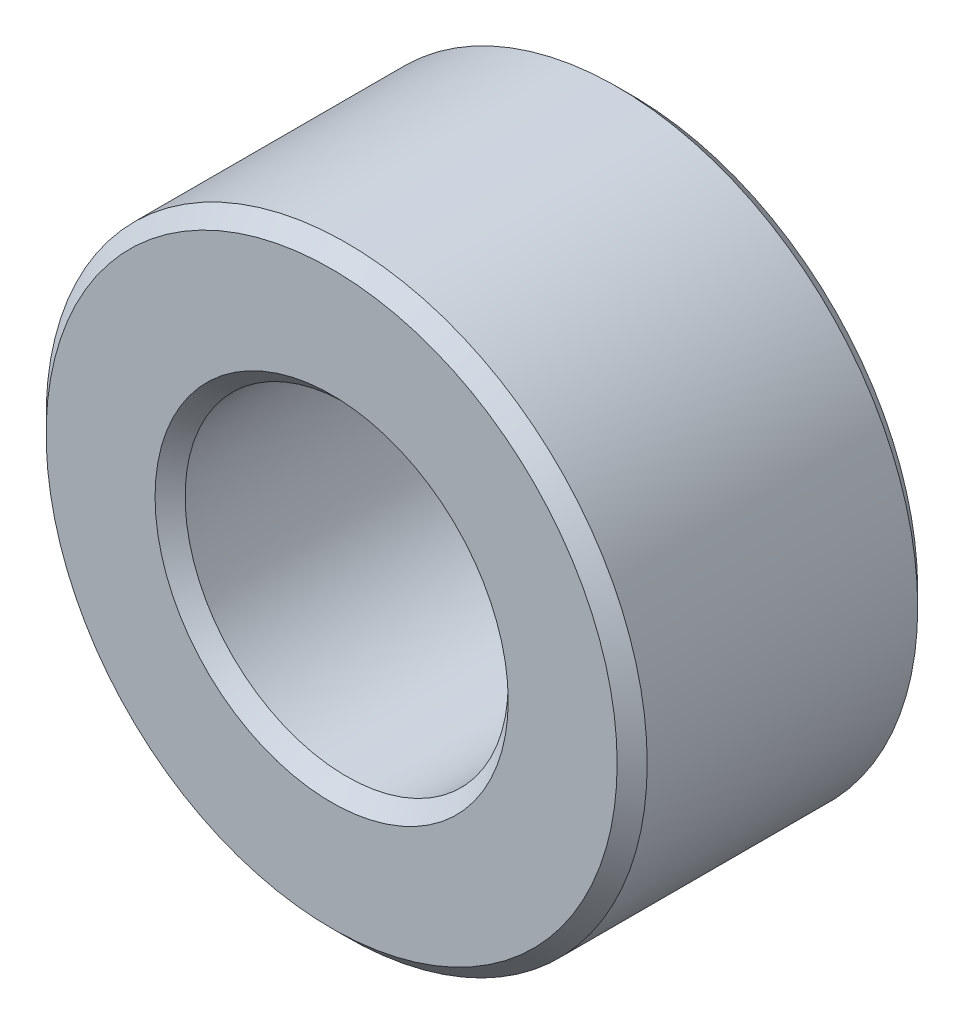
ISO-10303-21;
HEADER;
FILE_DESCRIPTION(('STEP AP214'),'2;1');
FILE_NAME('part.step','',(''),(''),'','','');
FILE_SCHEMA(('AUTOMOTIVE_DESIGN { 1 0 10303 214 1 1 1 1 }'));
ENDSEC;
DATA;
#1=APPLICATION_CONTEXT('core data for automotive mechanical design processes');
#2=APPLICATION_PROTOCOL_DEFINITION('international standard','automotive_design',2000,#1);
#3=PRODUCT_CONTEXT('',#1,'mechanical');
#4=PRODUCT('Part','Part','',(#3));
#5=PRODUCT_RELATED_PRODUCT_CATEGORY('part','',(#4));
#6=PRODUCT_DEFINITION_FORMATION('','',#4);
#7=PRODUCT_DEFINITION_CONTEXT('part definition',#1,'design');
#8=PRODUCT_DEFINITION('design','',#6,#7);
#9=PRODUCT_DEFINITION_SHAPE('','',#8);
#10=(LENGTH_UNIT() NAMED_UNIT(*) SI_UNIT(.MILLI.,.METRE.));
#11=(NAMED_UNIT(*) PLANE_ANGLE_UNIT() SI_UNIT($,.RADIAN.));
#12=(NAMED_UNIT(*) SI_UNIT($,.STERADIAN.) SOLID_ANGLE_UNIT());
#13=UNCERTAINTY_MEASURE_WITH_UNIT(LENGTH_MEASURE(1.E-05),#10,'distance_accuracy_value','');
#14=(GEOMETRIC_REPRESENTATION_CONTEXT(3) GLOBAL_UNCERTAINTY_ASSIGNED_CONTEXT((#13)) GLOBAL_UNIT_ASSIGNED_CONTEXT((#10,
#11,#12)) REPRESENTATION_CONTEXT('',''));
#15=CARTESIAN_POINT('',(0.,0.,0.));
#16=DIRECTION('',(0.,0.,1.));
#17=DIRECTION('',(1.,0.,0.));
#18=AXIS2_PLACEMENT_3D('',#15,#16,#17);
#19=CARTESIAN_POINT('',(0.,0.,2.));
#20=DIRECTION('',(0.,0.,1.));
#21=DIRECTION('',(1.,0.,0.));
#22=AXIS2_PLACEMENT_3D('',#19,#20,#21);
#23=PLANE('',#22);
#24=CARTESIAN_POINT('',(0.,0.,2.));
#25=DIRECTION('',(0.,0.,1.));
#26=DIRECTION('',(1.,0.,0.));
#27=AXIS2_PLACEMENT_3D('',#24,#25,#26);
#28=CIRCLE('',#27,2.35);
#29=CARTESIAN_POINT('',(2.35,0.,2.));
#30=VERTEX_POINT('',#29);
#31=EDGE_CURVE('E10',#30,#30,#28,.F.);
#32=ORIENTED_EDGE('',*,*,#31,.T.);
#33=EDGE_LOOP('',(#32));
#34=FACE_BOUND('',#33,.T.);
#35=CARTESIAN_POINT('',(0.,0.,2.));
#36=DIRECTION('',(0.,0.,1.));
#37=DIRECTION('',(1.,0.,0.));
#38=AXIS2_PLACEMENT_3D('',#35,#36,#37);
#39=CIRCLE('',#38,3.8);
#40=CARTESIAN_POINT('',(3.8,0.,2.));
#41=VERTEX_POINT('',#40);
#42=EDGE_CURVE('E45',#41,#41,#39,.T.);
#43=ORIENTED_EDGE('',*,*,#42,.T.);
#44=EDGE_LOOP('',(#43));
#45=FACE_BOUND('',#44,.T.);
#46=ADVANCED_FACE('F37',(#34,#45),#23,.T.);
#47=CARTESIAN_POINT('',(0.,0.,-2.));
#48=DIRECTION('',(0.,0.,1.));
#49=DIRECTION('',(1.,0.,0.));
#50=AXIS2_PLACEMENT_3D('',#47,#48,#49);
#51=PLANE('',#50);
#52=CARTESIAN_POINT('',(0.,0.,-2.));
#53=DIRECTION('',(0.,0.,1.));
#54=DIRECTION('',(1.,0.,0.));
#55=AXIS2_PLACEMENT_3D('',#52,#53,#54);
#56=CIRCLE('',#55,3.8);
#57=CARTESIAN_POINT('',(3.8,0.,-2.));
#58=VERTEX_POINT('',#57);
#59=EDGE_CURVE('E62',#58,#58,#56,.F.);
#60=ORIENTED_EDGE('',*,*,#59,.T.);
#61=EDGE_LOOP('',(#60));
#62=FACE_BOUND('',#61,.T.);
#63=CARTESIAN_POINT('',(0.,0.,-2.));
#64=DIRECTION('',(0.,0.,1.));
#65=DIRECTION('',(1.,0.,0.));
#66=AXIS2_PLACEMENT_3D('',#63,#64,#65);
#67=CIRCLE('',#66,2.35);
#68=CARTESIAN_POINT('',(2.35,0.,-2.));
#69=VERTEX_POINT('',#68);
#70=EDGE_CURVE('E65',#69,#69,#67,.T.);
#71=ORIENTED_EDGE('',*,*,#70,.T.);
#72=EDGE_LOOP('',(#71));
#73=FACE_BOUND('',#72,.T.);
#74=ADVANCED_FACE('F89',(#62,#73),#51,.F.);
#75=CARTESIAN_POINT('',(0.,0.,2.));
#76=DIRECTION('',(0.,0.,-1.));
#77=DIRECTION('',(-1.,0.,0.));
#78=AXIS2_PLACEMENT_3D('',#75,#76,#77);
#79=CYLINDRICAL_SURFACE('',#78,4.);
#80=CARTESIAN_POINT('',(0.,0.,-1.8));
#81=DIRECTION('',(0.,0.,1.));
#82=DIRECTION('',(1.,0.,0.));
#83=AXIS2_PLACEMENT_3D('',#80,#81,#82);
#84=CIRCLE('',#83,4.);
#85=CARTESIAN_POINT('',(4.,0.,-1.8));
#86=VERTEX_POINT('',#85);
#87=EDGE_CURVE('E69',#86,#86,#84,.T.);
#88=ORIENTED_EDGE('',*,*,#87,.T.);
#89=EDGE_LOOP('',(#88));
#90=FACE_BOUND('',#89,.T.);
#91=CARTESIAN_POINT('',(0.,0.,1.8));
#92=DIRECTION('',(0.,0.,1.));
#93=DIRECTION('',(1.,0.,0.));
#94=AXIS2_PLACEMENT_3D('',#91,#92,#93);
#95=CIRCLE('',#94,4.);
#96=CARTESIAN_POINT('',(4.,0.,1.8));
#97=VERTEX_POINT('',#96);
#98=EDGE_CURVE('E73',#97,#97,#95,.F.);
#99=ORIENTED_EDGE('',*,*,#98,.T.);
#100=EDGE_LOOP('',(#99));
#101=FACE_BOUND('',#100,.T.);
#102=ADVANCED_FACE('F78',(#90,#101),#79,.T.);
#103=CARTESIAN_POINT('',(0.,0.,2.));
#104=DIRECTION('',(0.,0.,-1.));
#105=DIRECTION('',(-1.,0.,0.));
#106=AXIS2_PLACEMENT_3D('',#103,#104,#105);
#107=CYLINDRICAL_SURFACE('',#106,2.15);
#108=CARTESIAN_POINT('',(0.,0.,-1.8));
#109=DIRECTION('',(0.,0.,1.));
#110=DIRECTION('',(1.,0.,0.));
#111=AXIS2_PLACEMENT_3D('',#108,#109,#110);
#112=CIRCLE('',#111,2.15);
#113=CARTESIAN_POINT('',(2.15,0.,-1.8));
#114=VERTEX_POINT('',#113);
#115=EDGE_CURVE('E51',#114,#114,#112,.F.);
#116=ORIENTED_EDGE('',*,*,#115,.T.);
#117=EDGE_LOOP('',(#116));
#118=FACE_BOUND('',#117,.T.);
#119=CARTESIAN_POINT('',(0.,0.,1.8));
#120=DIRECTION('',(0.,0.,1.));
#121=DIRECTION('',(1.,0.,0.));
#122=AXIS2_PLACEMENT_3D('',#119,#120,#121);
#123=CIRCLE('',#122,2.15);
#124=CARTESIAN_POINT('',(2.15,0.,1.8));
#125=VERTEX_POINT('',#124);
#126=EDGE_CURVE('E57',#125,#125,#123,.T.);
#127=ORIENTED_EDGE('',*,*,#126,.T.);
#128=EDGE_LOOP('',(#127));
#129=FACE_BOUND('',#128,.T.);
#130=ADVANCED_FACE('F97',(#118,#129),#107,.F.);
#131=CARTESIAN_POINT('',(0.,0.,-1.8));
#132=DIRECTION('',(0.,0.,1.));
#133=DIRECTION('',(1.,0.,0.));
#134=AXIS2_PLACEMENT_3D('',#131,#132,#133);
#135=CONICAL_SURFACE('',#134,4.,0.785398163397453);
#136=ORIENTED_EDGE('',*,*,#59,.F.);
#137=EDGE_LOOP('',(#136));
#138=FACE_BOUND('',#137,.T.);
#139=ORIENTED_EDGE('',*,*,#87,.F.);
#140=EDGE_LOOP('',(#139));
#141=FACE_BOUND('',#140,.T.);
#142=ADVANCED_FACE('F102',(#138,#141),#135,.T.);
#143=CARTESIAN_POINT('',(0.,0.,-2.));
#144=DIRECTION('',(0.,0.,-1.));
#145=DIRECTION('',(-1.,0.,0.));
#146=AXIS2_PLACEMENT_3D('',#143,#144,#145);
#147=CONICAL_SURFACE('',#146,2.35,0.785398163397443);
#148=ORIENTED_EDGE('',*,*,#115,.F.);
#149=EDGE_LOOP('',(#148));
#150=FACE_BOUND('',#149,.T.);
#151=ORIENTED_EDGE('',*,*,#70,.F.);
#152=EDGE_LOOP('',(#151));
#153=FACE_BOUND('',#152,.T.);
#154=ADVANCED_FACE('F86',(#150,#153),#147,.F.);
#155=CARTESIAN_POINT('',(0.,0.,1.8));
#156=DIRECTION('',(0.,0.,1.));
#157=DIRECTION('',(1.,0.,0.));
#158=AXIS2_PLACEMENT_3D('',#155,#156,#157);
#159=CONICAL_SURFACE('',#158,2.15,0.785398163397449);
#160=CARTESIAN_POINT('',(2.35,0.,2.));
#161=CARTESIAN_POINT('',(2.34791666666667,0.,1.99791666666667));
#162=CARTESIAN_POINT('',(2.34583333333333,0.,1.99583333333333));
#163=CARTESIAN_POINT('',(2.34166666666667,0.,1.99166666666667));
#164=CARTESIAN_POINT('',(2.33958333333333,0.,1.98958333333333));
#165=CARTESIAN_POINT('',(2.33541666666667,0.,1.98541666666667));
#166=CARTESIAN_POINT('',(2.33333333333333,0.,1.98333333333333));
#167=CARTESIAN_POINT('',(2.32916666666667,0.,1.97916666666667));
#168=CARTESIAN_POINT('',(2.32708333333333,0.,1.97708333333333));
#169=CARTESIAN_POINT('',(2.32291666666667,0.,1.97291666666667));
#170=CARTESIAN_POINT('',(2.32083333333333,0.,1.97083333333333));
#171=CARTESIAN_POINT('',(2.31666666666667,0.,1.96666666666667));
#172=CARTESIAN_POINT('',(2.31458333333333,0.,1.96458333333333));
#173=CARTESIAN_POINT('',(2.31041666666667,0.,1.96041666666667));
#174=CARTESIAN_POINT('',(2.30833333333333,0.,1.95833333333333));
#175=CARTESIAN_POINT('',(2.30416666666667,0.,1.95416666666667));
#176=CARTESIAN_POINT('',(2.30208333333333,0.,1.95208333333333));
#177=CARTESIAN_POINT('',(2.29791666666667,0.,1.94791666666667));
#178=CARTESIAN_POINT('',(2.29583333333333,0.,1.94583333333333));
#179=CARTESIAN_POINT('',(2.29166666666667,0.,1.94166666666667));
#180=CARTESIAN_POINT('',(2.28958333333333,0.,1.93958333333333));
#181=CARTESIAN_POINT('',(2.28541666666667,0.,1.93541666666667));
#182=CARTESIAN_POINT('',(2.28333333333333,0.,1.93333333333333));
#183=CARTESIAN_POINT('',(2.27916666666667,0.,1.92916666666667));
#184=CARTESIAN_POINT('',(2.27708333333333,0.,1.92708333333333));
#185=CARTESIAN_POINT('',(2.27291666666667,0.,1.92291666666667));
#186=CARTESIAN_POINT('',(2.27083333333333,0.,1.92083333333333));
#187=CARTESIAN_POINT('',(2.26666666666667,0.,1.91666666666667));
#188=CARTESIAN_POINT('',(2.26458333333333,0.,1.91458333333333));
#189=CARTESIAN_POINT('',(2.26041666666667,0.,1.91041666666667));
#190=CARTESIAN_POINT('',(2.25833333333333,0.,1.90833333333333));
#191=CARTESIAN_POINT('',(2.25416666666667,0.,1.90416666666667));
#192=CARTESIAN_POINT('',(2.25208333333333,0.,1.90208333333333));
#193=CARTESIAN_POINT('',(2.24791666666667,0.,1.89791666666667));
#194=CARTESIAN_POINT('',(2.24583333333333,0.,1.89583333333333));
#195=CARTESIAN_POINT('',(2.24166666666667,0.,1.89166666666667));
#196=CARTESIAN_POINT('',(2.23958333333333,0.,1.88958333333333));
#197=CARTESIAN_POINT('',(2.23541666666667,0.,1.88541666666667));
#198=CARTESIAN_POINT('',(2.23333333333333,0.,1.88333333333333));
#199=CARTESIAN_POINT('',(2.22916666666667,0.,1.87916666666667));
#200=CARTESIAN_POINT('',(2.22708333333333,0.,1.87708333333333));
#201=CARTESIAN_POINT('',(2.22291666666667,0.,1.87291666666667));
#202=CARTESIAN_POINT('',(2.22083333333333,0.,1.87083333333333));
#203=CARTESIAN_POINT('',(2.21666666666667,0.,1.86666666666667));
#204=CARTESIAN_POINT('',(2.21458333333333,0.,1.86458333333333));
#205=CARTESIAN_POINT('',(2.21041666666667,0.,1.86041666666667));
#206=CARTESIAN_POINT('',(2.20833333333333,0.,1.85833333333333));
#207=CARTESIAN_POINT('',(2.20416666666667,0.,1.85416666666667));
#208=CARTESIAN_POINT('',(2.20208333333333,0.,1.85208333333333));
#209=CARTESIAN_POINT('',(2.19791666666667,0.,1.84791666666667));
#210=CARTESIAN_POINT('',(2.19583333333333,0.,1.84583333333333));
#211=CARTESIAN_POINT('',(2.19166666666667,0.,1.84166666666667));
#212=CARTESIAN_POINT('',(2.18958333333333,0.,1.83958333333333));
#213=CARTESIAN_POINT('',(2.18541666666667,0.,1.83541666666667));
#214=CARTESIAN_POINT('',(2.18333333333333,0.,1.83333333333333));
#215=CARTESIAN_POINT('',(2.17916666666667,0.,1.82916666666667));
#216=CARTESIAN_POINT('',(2.17708333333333,0.,1.82708333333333));
#217=CARTESIAN_POINT('',(2.17291666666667,0.,1.82291666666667));
#218=CARTESIAN_POINT('',(2.17083333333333,0.,1.82083333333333));
#219=CARTESIAN_POINT('',(2.16666666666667,0.,1.81666666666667));
#220=CARTESIAN_POINT('',(2.16458333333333,0.,1.81458333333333));
#221=CARTESIAN_POINT('',(2.16041666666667,0.,1.81041666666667));
#222=CARTESIAN_POINT('',(2.15833333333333,0.,1.80833333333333));
#223=CARTESIAN_POINT('',(2.15416666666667,0.,1.80416666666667));
#224=CARTESIAN_POINT('',(2.15208333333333,0.,1.80208333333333));
#225=CARTESIAN_POINT('',(2.15,0.,1.8));
#226=B_SPLINE_CURVE_WITH_KNOTS('',3,(#160,#161,#162,#163,#164,#165,#166,#167,#168,#169,#170,
#171,#172,#173,#174,#175,#176,#177,#178,#179,#180,#181,#182,#183,#184,#185,#186,#187,#188,#189,
#190,#191,#192,#193,#194,#195,#196,#197,#198,#199,#200,#201,#202,#203,#204,#205,#206,#207,#208,
#209,#210,#211,#212,#213,#214,#215,#216,#217,#218,#219,#220,#221,#222,#223,#224,#225),
.UNSPECIFIED.,.F.,.F.,(4,2,2,2,2,2,2,2,2,2,2,2,2,2,2,2,2,2,2,2,2,2,2,2,2,2,2,2,2,2,2,2,4),(0.,
0.00883883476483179,0.0176776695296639,0.0265165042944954,0.0353553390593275,0.0441941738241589,
0.053033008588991,0.0618718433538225,0.0707106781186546,0.0795495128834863,0.0883883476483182,
0.0972271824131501,0.106066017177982,0.114904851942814,0.123743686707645,0.132582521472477,
0.141421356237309,0.150260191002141,0.159099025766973,0.167937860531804,0.176776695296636,
0.185615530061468,0.1944543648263,0.203293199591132,0.212132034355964,0.220970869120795,
0.229809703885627,0.238648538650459,0.247487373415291,0.256326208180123,0.265165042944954,
0.274003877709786,0.282842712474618),.UNSPECIFIED.);
#227=EDGE_CURVE('BSEAM82',#30,#125,#226,.T.);
#228=ORIENTED_EDGE('',*,*,#31,.F.);
#229=ORIENTED_EDGE('',*,*,#126,.F.);
#230=ORIENTED_EDGE('',*,*,#227,.T.);
#231=ORIENTED_EDGE('',*,*,#227,.F.);
#232=EDGE_LOOP('',(#228,#230,#229,#231));
#233=FACE_BOUND('',#232,.T.);
#234=ADVANCED_FACE('F82',(#233),#159,.F.);
#235=CARTESIAN_POINT('',(0.,0.,2.));
#236=DIRECTION('',(0.,0.,-1.));
#237=DIRECTION('',(-1.,0.,0.));
#238=AXIS2_PLACEMENT_3D('',#235,#236,#237);
#239=CONICAL_SURFACE('',#238,3.8,0.785398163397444);
#240=ORIENTED_EDGE('',*,*,#98,.F.);
#241=EDGE_LOOP('',(#240));
#242=FACE_BOUND('',#241,.T.);
#243=ORIENTED_EDGE('',*,*,#42,.F.);
#244=EDGE_LOOP('',(#243));
#245=FACE_BOUND('',#244,.T.);
#246=ADVANCED_FACE('F39',(#242,#245),#239,.T.);
#247=CLOSED_SHELL('',(#46,#74,#102,#130,#142,#154,#234,#246));
#248=MANIFOLD_SOLID_BREP('B2',#247);
#249=ADVANCED_BREP_SHAPE_REPRESENTATION('',(#18,#248),#14);
#250=SHAPE_DEFINITION_REPRESENTATION(#9,#249);
ENDSEC;
END-ISO-10303-21;
